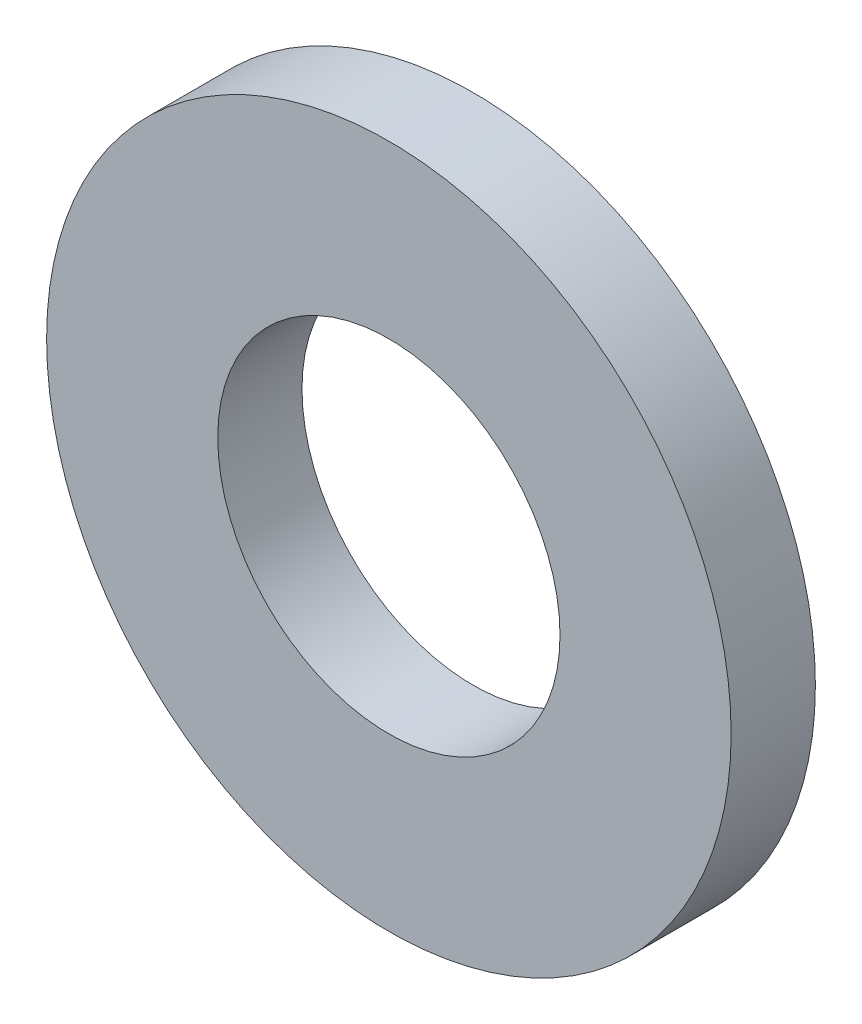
from build123d import *

# Parameters (mm, degrees)
ESQUISSE1_R          = 3.25
ESQUISSE1_R_2        = 1.625
BASE_EXTRUSION_DEPTH = 0.8


with BuildPart() as part:
    # Esquisse1 → Base-Extrusion (new body)
    with BuildSketch(Plane.XY):
        Circle(ESQUISSE1_R)
        Circle(ESQUISSE1_R_2, mode=Mode.SUBTRACT)
    extrude(amount=BASE_EXTRUSION_DEPTH)


solid = part.part
